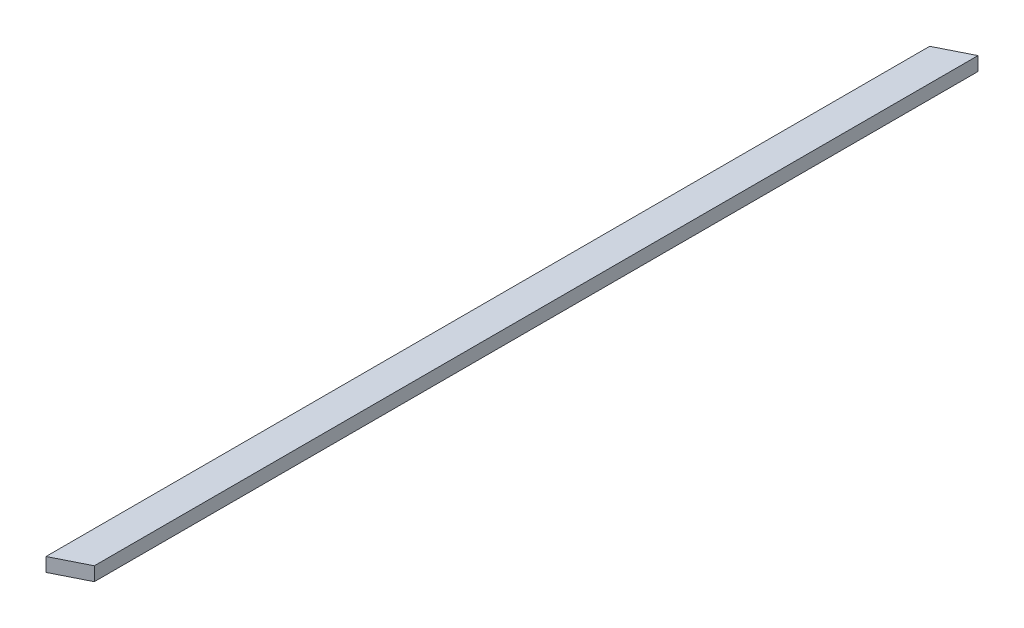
from build123d import *

# Parameters (mm, degrees)
BOSS_EXTRUDE1_DEPTH = 38.1


with BuildPart() as part:
    # Sketch1 → Boss-Extrude1 (new body)
    with BuildSketch(Plane(origin=(0, 0, 0), x_dir=(1, 0, 0), z_dir=(0, 1, 0))):
        Polygon((0, 0), (0, -2438.4), (-88.9, -2482.859598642), (-88.9, -44.459598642), align=None)
    extrude(amount=BOSS_EXTRUDE1_DEPTH)


solid = part.part
